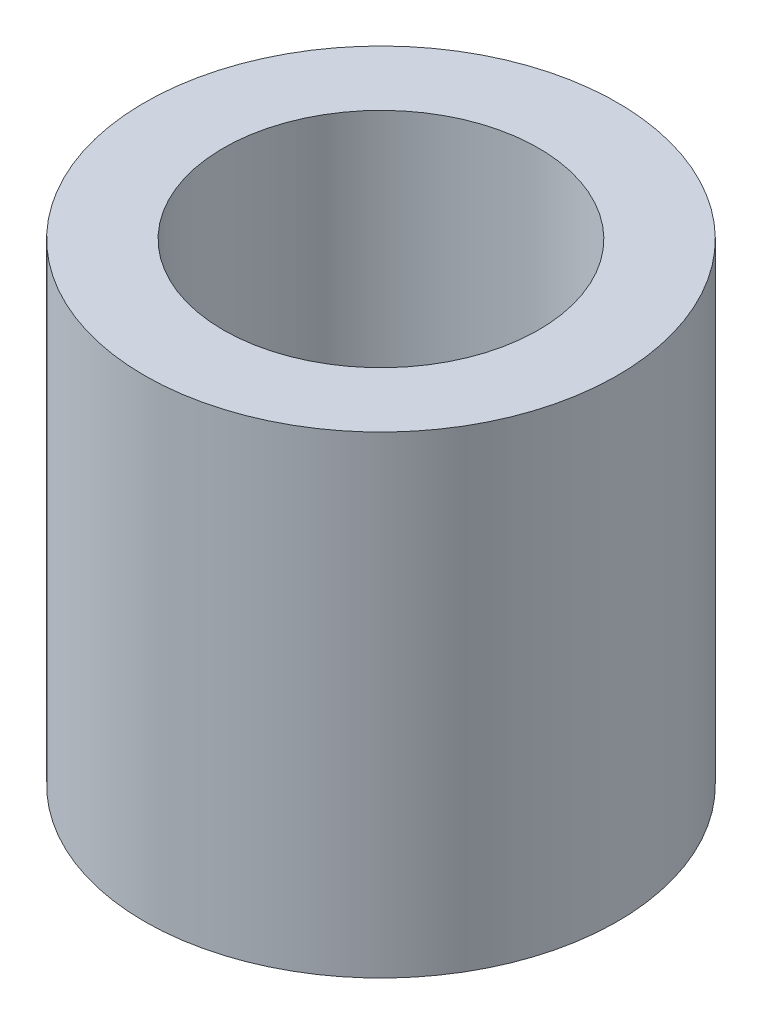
ISO-10303-21;
HEADER;
FILE_DESCRIPTION(('STEP AP214'),'2;1');
FILE_NAME('part.step','',(''),(''),'','','');
FILE_SCHEMA(('AUTOMOTIVE_DESIGN { 1 0 10303 214 1 1 1 1 }'));
ENDSEC;
DATA;
#1=APPLICATION_CONTEXT('core data for automotive mechanical design processes');
#2=APPLICATION_PROTOCOL_DEFINITION('international standard','automotive_design',2000,#1);
#3=PRODUCT_CONTEXT('',#1,'mechanical');
#4=PRODUCT('Part','Part','',(#3));
#5=PRODUCT_RELATED_PRODUCT_CATEGORY('part','',(#4));
#6=PRODUCT_DEFINITION_FORMATION('','',#4);
#7=PRODUCT_DEFINITION_CONTEXT('part definition',#1,'design');
#8=PRODUCT_DEFINITION('design','',#6,#7);
#9=PRODUCT_DEFINITION_SHAPE('','',#8);
#10=(LENGTH_UNIT() NAMED_UNIT(*) SI_UNIT(.MILLI.,.METRE.));
#11=(NAMED_UNIT(*) PLANE_ANGLE_UNIT() SI_UNIT($,.RADIAN.));
#12=(NAMED_UNIT(*) SI_UNIT($,.STERADIAN.) SOLID_ANGLE_UNIT());
#13=UNCERTAINTY_MEASURE_WITH_UNIT(LENGTH_MEASURE(1.E-05),#10,'distance_accuracy_value','');
#14=(GEOMETRIC_REPRESENTATION_CONTEXT(3) GLOBAL_UNCERTAINTY_ASSIGNED_CONTEXT((#13)) GLOBAL_UNIT_ASSIGNED_CONTEXT((#10,
#11,#12)) REPRESENTATION_CONTEXT('',''));
#15=CARTESIAN_POINT('',(0.,0.,0.));
#16=DIRECTION('',(0.,0.,1.));
#17=DIRECTION('',(1.,0.,0.));
#18=AXIS2_PLACEMENT_3D('',#15,#16,#17);
#19=CARTESIAN_POINT('',(0.,12.,0.));
#20=DIRECTION('',(0.,1.,0.));
#21=DIRECTION('',(0.,0.,1.));
#22=AXIS2_PLACEMENT_3D('',#19,#20,#21);
#23=PLANE('',#22);
#24=CARTESIAN_POINT('',(0.,12.,0.));
#25=DIRECTION('',(0.,1.,0.));
#26=DIRECTION('',(0.,0.,1.));
#27=AXIS2_PLACEMENT_3D('',#24,#25,#26);
#28=CIRCLE('',#27,6.00000000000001);
#29=CARTESIAN_POINT('',(0.,12.,6.00000000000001));
#30=VERTEX_POINT('',#29);
#31=EDGE_CURVE('E10',#30,#30,#28,.T.);
#32=ORIENTED_EDGE('',*,*,#31,.T.);
#33=EDGE_LOOP('',(#32));
#34=FACE_BOUND('',#33,.T.);
#35=CARTESIAN_POINT('',(0.,12.,0.));
#36=DIRECTION('',(0.,1.,0.));
#37=DIRECTION('',(0.,0.,1.));
#38=AXIS2_PLACEMENT_3D('',#35,#36,#37);
#39=CIRCLE('',#38,4.);
#40=CARTESIAN_POINT('',(0.,12.,4.));
#41=VERTEX_POINT('',#40);
#42=EDGE_CURVE('E35',#41,#41,#39,.T.);
#43=ORIENTED_EDGE('',*,*,#42,.F.);
#44=EDGE_LOOP('',(#43));
#45=FACE_BOUND('',#44,.T.);
#46=ADVANCED_FACE('F24',(#34,#45),#23,.T.);
#47=CARTESIAN_POINT('',(0.,0.,0.));
#48=DIRECTION('',(0.,1.,0.));
#49=DIRECTION('',(0.,0.,1.));
#50=AXIS2_PLACEMENT_3D('',#47,#48,#49);
#51=PLANE('',#50);
#52=CARTESIAN_POINT('',(0.,0.,0.));
#53=DIRECTION('',(0.,1.,0.));
#54=DIRECTION('',(0.,0.,1.));
#55=AXIS2_PLACEMENT_3D('',#52,#53,#54);
#56=CIRCLE('',#55,6.00000000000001);
#57=CARTESIAN_POINT('',(0.,0.,6.00000000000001));
#58=VERTEX_POINT('',#57);
#59=EDGE_CURVE('E31',#58,#58,#56,.T.);
#60=ORIENTED_EDGE('',*,*,#59,.F.);
#61=EDGE_LOOP('',(#60));
#62=FACE_BOUND('',#61,.T.);
#63=CARTESIAN_POINT('',(0.,0.,0.));
#64=DIRECTION('',(0.,1.,0.));
#65=DIRECTION('',(0.,0.,1.));
#66=AXIS2_PLACEMENT_3D('',#63,#64,#65);
#67=CIRCLE('',#66,4.);
#68=CARTESIAN_POINT('',(0.,0.,4.));
#69=VERTEX_POINT('',#68);
#70=EDGE_CURVE('E39',#69,#69,#67,.T.);
#71=ORIENTED_EDGE('',*,*,#70,.T.);
#72=EDGE_LOOP('',(#71));
#73=FACE_BOUND('',#72,.T.);
#74=ADVANCED_FACE('F45',(#62,#73),#51,.F.);
#75=CARTESIAN_POINT('',(0.,12.,0.));
#76=DIRECTION('',(0.,-1.,0.));
#77=DIRECTION('',(0.,0.,-1.));
#78=AXIS2_PLACEMENT_3D('',#75,#76,#77);
#79=CYLINDRICAL_SURFACE('',#78,6.00000000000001);
#80=ORIENTED_EDGE('',*,*,#31,.F.);
#81=EDGE_LOOP('',(#80));
#82=FACE_BOUND('',#81,.T.);
#83=ORIENTED_EDGE('',*,*,#59,.T.);
#84=EDGE_LOOP('',(#83));
#85=FACE_BOUND('',#84,.T.);
#86=ADVANCED_FACE('F26',(#82,#85),#79,.T.);
#87=CARTESIAN_POINT('',(0.,12.,0.));
#88=DIRECTION('',(0.,-1.,0.));
#89=DIRECTION('',(0.,0.,-1.));
#90=AXIS2_PLACEMENT_3D('',#87,#88,#89);
#91=CYLINDRICAL_SURFACE('',#90,4.);
#92=ORIENTED_EDGE('',*,*,#42,.T.);
#93=EDGE_LOOP('',(#92));
#94=FACE_BOUND('',#93,.T.);
#95=ORIENTED_EDGE('',*,*,#70,.F.);
#96=EDGE_LOOP('',(#95));
#97=FACE_BOUND('',#96,.T.);
#98=ADVANCED_FACE('F47',(#94,#97),#91,.F.);
#99=CLOSED_SHELL('',(#46,#74,#86,#98));
#100=MANIFOLD_SOLID_BREP('B2',#99);
#101=ADVANCED_BREP_SHAPE_REPRESENTATION('',(#18,#100),#14);
#102=SHAPE_DEFINITION_REPRESENTATION(#9,#101);
ENDSEC;
END-ISO-10303-21;
